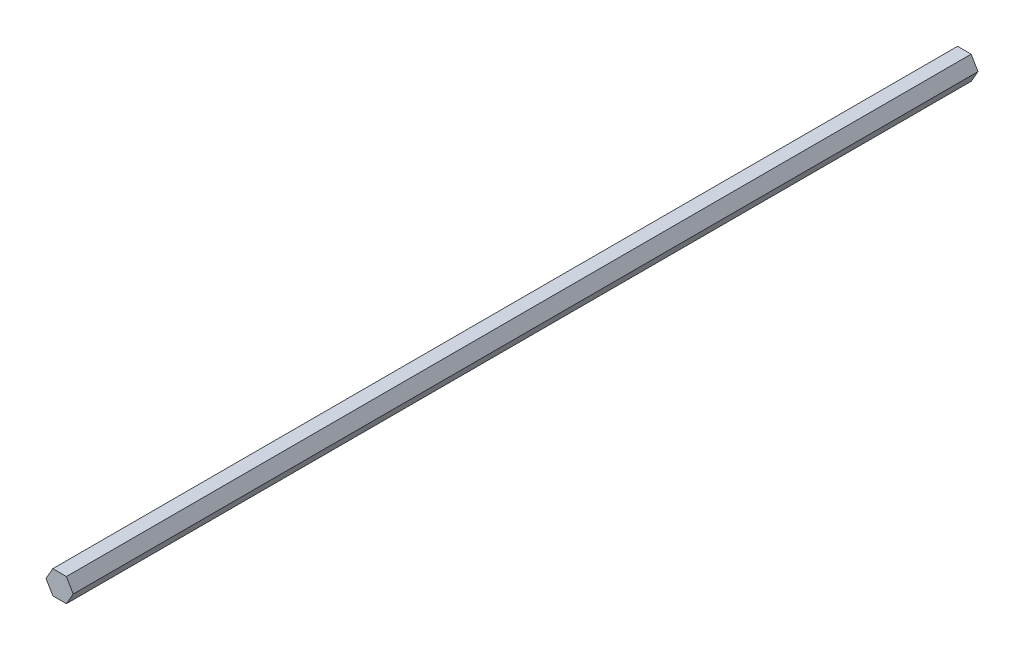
from build123d import *

# Parameters (mm, degrees)
BASE_EXTRUDE_DEPTH = 304.8


with BuildPart() as part:
    # Sketch1 → Base-Extrude (new body)
    with BuildSketch(Plane.XY):
        Polygon((4.582717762, 0), (2.291358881, 3.96875), (-2.291358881, 3.96875), (-4.582717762, 0), (-2.291358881, -3.96875), (2.291358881, -3.96875), align=None)
    extrude(amount=BASE_EXTRUDE_DEPTH)


solid = part.part
